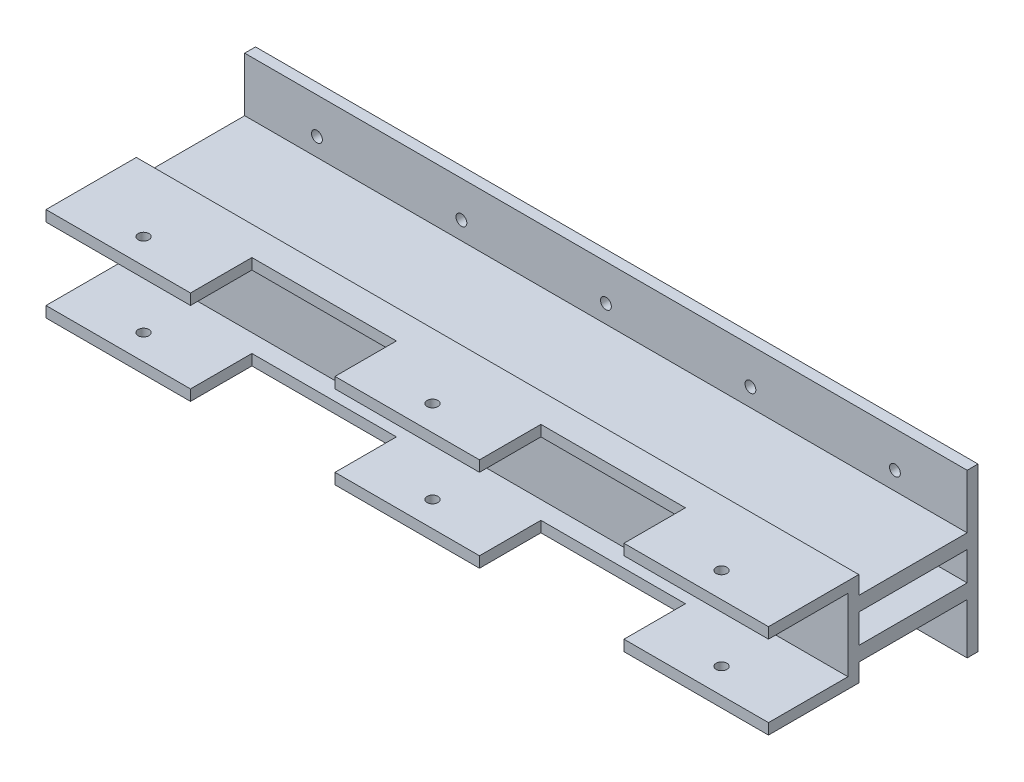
from build123d import *

# Parameters (mm, degrees)
SKETCH_1_W          = 200
SKETCH_1_H          = 25
EXTRUDE_1_DEPTH     = 3
SKETCH_2_W          = 200
SKETCH_2_H          = 3
EXTRUDE_2_DEPTH     = 20
SKETCH_3_W          = 200
SKETCH_3_H          = 25
EXTRUDE_4_DEPTH     = 3
CUT_EXTRUDE_1_REACH = 106.078
SKETCH_4_R          = 1.5
SKETCH_5_W          = 200
SKETCH_5_H          = 4
EXTRUDE_5_DEPTH     = 30
SKETCH_6_W          = 200
SKETCH_6_H          = 45
SKETCH_6_R          = 1.5
EXTRUDE_6_DEPTH     = 3
CUT_EXTRUDE_2_REACH = 117.305
SKETCH_7_W          = 40
SKETCH_7_H          = 17
CUT_EXTRUDE_3_DEPTH = 3


with BuildPart() as part:
    # Sketch 1 → Extrude 1 (new body)
    with BuildSketch(Plane(origin=(0, 0, 0), x_dir=(1, 0, 0), z_dir=(0, 1, 0))):
        Rectangle(SKETCH_1_W, SKETCH_1_H)
    extrude(amount=EXTRUDE_1_DEPTH)

    # Sketch 2 → Extrude 2 (add)
    with BuildSketch(Plane.XZ):
        with Locations((0, -11)):
            Rectangle(SKETCH_2_W, SKETCH_2_H)
    extrude(amount=EXTRUDE_2_DEPTH)

    # Sketch 3 → Extrude 4 (add)
    with BuildSketch(Plane.XZ.offset(20)):
        Rectangle(SKETCH_3_W, SKETCH_3_H)
    extrude(amount=EXTRUDE_4_DEPTH)

    # Cut-Extrude 1: up to this face of the body (flat: up to its plane)
    cut_extrude_1_end = Plane(part.part.faces().sort_by_distance((0, -23, 0))[0])
    # Sketch 4 → Cut-Extrude 1 (cut, up to the picked face)
    with BuildSketch(Plane(origin=(0, 3, 0), x_dir=(1, 0, 0), z_dir=(0, 1, 0)), mode=Mode.PRIVATE) as cut_extrude_1_sk1:
        with Locations(Location((-80, -5.5, 0), (0, 0, 90))):
            Circle(SKETCH_4_R)
    cut_extrude_1_tool1 = split(extrude(cut_extrude_1_sk1.sketch, amount=-CUT_EXTRUDE_1_REACH, mode=Mode.PRIVATE), bisect_by=cut_extrude_1_end, keep=Keep.BOTH, mode=Mode.PRIVATE)
    # Sketch 4 → Cut-Extrude 1 (cut, up to the picked face)
    with BuildSketch(Plane(origin=(0, 3, 0), x_dir=(1, 0, 0), z_dir=(0, 1, 0)), mode=Mode.PRIVATE) as cut_extrude_1_sk2:
        with Locations(Location((-40, -5.5, 0), (0, 0, 90))):
            Circle(SKETCH_4_R)
    cut_extrude_1_tool2 = split(extrude(cut_extrude_1_sk2.sketch, amount=-CUT_EXTRUDE_1_REACH, mode=Mode.PRIVATE), bisect_by=cut_extrude_1_end, keep=Keep.BOTH, mode=Mode.PRIVATE)
    # Sketch 4 → Cut-Extrude 1 (cut, up to the picked face)
    with BuildSketch(Plane(origin=(0, 3, 0), x_dir=(1, 0, 0), z_dir=(0, 1, 0)), mode=Mode.PRIVATE) as cut_extrude_1_sk3:
        with Locations(Location((0, -5.5, 0), (0, 0, 90))):
            Circle(SKETCH_4_R)
    cut_extrude_1_tool3 = split(extrude(cut_extrude_1_sk3.sketch, amount=-CUT_EXTRUDE_1_REACH, mode=Mode.PRIVATE), bisect_by=cut_extrude_1_end, keep=Keep.BOTH, mode=Mode.PRIVATE)
    # Sketch 4 → Cut-Extrude 1 (cut, up to the picked face)
    with BuildSketch(Plane(origin=(0, 3, 0), x_dir=(1, 0, 0), z_dir=(0, 1, 0)), mode=Mode.PRIVATE) as cut_extrude_1_sk4:
        with Locations(Location((40, -5.5, 0), (0, 0, 90))):
            Circle(SKETCH_4_R)
    cut_extrude_1_tool4 = split(extrude(cut_extrude_1_sk4.sketch, amount=-CUT_EXTRUDE_1_REACH, mode=Mode.PRIVATE), bisect_by=cut_extrude_1_end, keep=Keep.BOTH, mode=Mode.PRIVATE)
    # Sketch 4 → Cut-Extrude 1 (cut, up to the picked face)
    with BuildSketch(Plane(origin=(0, 3, 0), x_dir=(1, 0, 0), z_dir=(0, 1, 0)), mode=Mode.PRIVATE) as cut_extrude_1_sk5:
        with Locations(Location((80, -5.5, 0), (0, 0, 90))):
            Circle(SKETCH_4_R)
    cut_extrude_1_tool5 = split(extrude(cut_extrude_1_sk5.sketch, amount=-CUT_EXTRUDE_1_REACH, mode=Mode.PRIVATE), bisect_by=cut_extrude_1_end, keep=Keep.BOTH, mode=Mode.PRIVATE)
    add(cut_extrude_1_tool1.solids().sort_by(Axis((-80, 3, 5.5), (0, -1, 0)))[0], mode=Mode.SUBTRACT)
    add(cut_extrude_1_tool2.solids().sort_by(Axis((-40, 3, 5.5), (0, -1, 0)))[0], mode=Mode.SUBTRACT)
    add(cut_extrude_1_tool3.solids().sort_by(Axis((0, 3, 5.5), (0, -1, 0)))[0], mode=Mode.SUBTRACT)
    add(cut_extrude_1_tool4.solids().sort_by(Axis((40, 3, 5.5), (0, -1, 0)))[0], mode=Mode.SUBTRACT)
    add(cut_extrude_1_tool5.solids().sort_by(Axis((80, 3, 5.5), (0, -1, 0)))[0], mode=Mode.SUBTRACT)

    # Sketch 5 → Extrude 5 (add)
    with BuildSketch(Plane(origin=(0, 0, -12.5), x_dir=(-1, 0, 0), z_dir=(0, 0, -1))):
        with Locations((0, -4)):
            Rectangle(SKETCH_5_W, SKETCH_5_H)
        with Locations((0, -16)):
            Rectangle(SKETCH_5_W, SKETCH_5_H)
    extrude(amount=EXTRUDE_5_DEPTH)

    # Sketch 6 → Extrude 6 (add)
    with BuildSketch(Plane(origin=(0, 0, -42.5), x_dir=(-1, 0, 0), z_dir=(0, 0, -1))):
        with Locations((0, -9.5)):
            Rectangle(SKETCH_6_W, SKETCH_6_H)
        with Locations((-80, 3)):
            Circle(SKETCH_6_R, mode=Mode.SUBTRACT)
        with Locations((-80, -23)):
            Circle(SKETCH_6_R, mode=Mode.SUBTRACT)
        with Locations((-40, 3)):
            Circle(SKETCH_6_R, mode=Mode.SUBTRACT)
        with Locations((-40, -23)):
            Circle(SKETCH_6_R, mode=Mode.SUBTRACT)
        with Locations((0, 3)):
            Circle(SKETCH_6_R, mode=Mode.SUBTRACT)
        with Locations((0, -23)):
            Circle(SKETCH_6_R, mode=Mode.SUBTRACT)
        with Locations((40, 3)):
            Circle(SKETCH_6_R, mode=Mode.SUBTRACT)
        with Locations((40, -23)):
            Circle(SKETCH_6_R, mode=Mode.SUBTRACT)
        with Locations((80, 3)):
            Circle(SKETCH_6_R, mode=Mode.SUBTRACT)
        with Locations((80, -23)):
            Circle(SKETCH_6_R, mode=Mode.SUBTRACT)
    extrude(amount=EXTRUDE_6_DEPTH)

    # Cut-Extrude 2: up to this face of the body (flat: up to its plane)
    cut_extrude_2_end = Plane(part.part.faces().sort_by_distance((0, -23, -0.039153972))[0])
    # Sketch 7 → Cut-Extrude 2 (cut, up to the picked face)
    with BuildSketch(Plane(origin=(0, 3, 0), x_dir=(1, 0, 0), z_dir=(0, 1, 0)), mode=Mode.PRIVATE) as cut_extrude_2_sk1:
        with Locations((-40, -4)):
            Rectangle(SKETCH_7_W, SKETCH_7_H)
    cut_extrude_2_tool1 = split(extrude(cut_extrude_2_sk1.sketch, amount=-CUT_EXTRUDE_2_REACH, mode=Mode.PRIVATE), bisect_by=cut_extrude_2_end, keep=Keep.BOTH, mode=Mode.PRIVATE)
    # Sketch 7 → Cut-Extrude 2 (cut, up to the picked face)
    with BuildSketch(Plane(origin=(0, 3, 0), x_dir=(1, 0, 0), z_dir=(0, 1, 0)), mode=Mode.PRIVATE) as cut_extrude_2_sk2:
        with Locations((40, -4)):
            Rectangle(SKETCH_7_W, SKETCH_7_H)
    cut_extrude_2_tool2 = split(extrude(cut_extrude_2_sk2.sketch, amount=-CUT_EXTRUDE_2_REACH, mode=Mode.PRIVATE), bisect_by=cut_extrude_2_end, keep=Keep.BOTH, mode=Mode.PRIVATE)
    add(cut_extrude_2_tool1.solids().sort_by(Axis((-40, 3, 4), (0, -1, 0)))[0], mode=Mode.SUBTRACT)
    add(cut_extrude_2_tool2.solids().sort_by(Axis((40, 3, 4), (0, -1, 0)))[0], mode=Mode.SUBTRACT)

    # Sketch 9 → Cut-Extrude 3 (cut)
    with BuildSketch(Plane(origin=(0, 0, -45.5), x_dir=(-1, 0, 0), z_dir=(0, 0, -1))):
        Polygon((-18, -20), (-18, -32), (18, -32), (18, -20), (0, -20), align=None)
    extrude(amount=-CUT_EXTRUDE_3_DEPTH, mode=Mode.SUBTRACT)


solid = part.part
